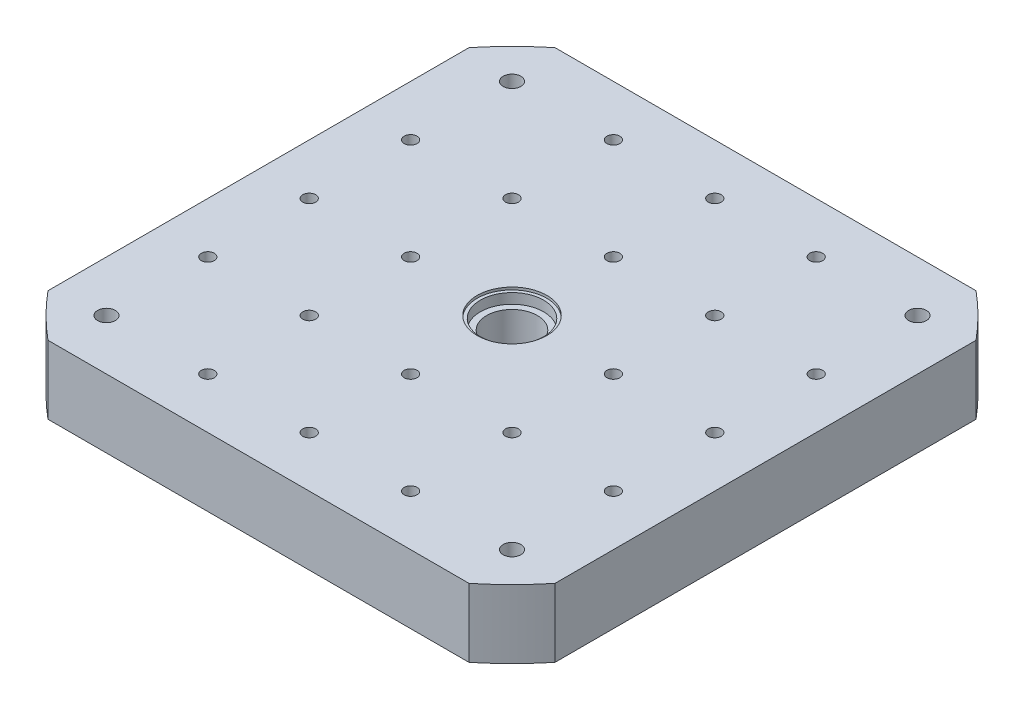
ISO-10303-21;
HEADER;
FILE_DESCRIPTION(('STEP AP214'),'2;1');
FILE_NAME('part.step','',(''),(''),'','','');
FILE_SCHEMA(('AUTOMOTIVE_DESIGN { 1 0 10303 214 1 1 1 1 }'));
ENDSEC;
DATA;
#1=APPLICATION_CONTEXT('core data for automotive mechanical design processes');
#2=APPLICATION_PROTOCOL_DEFINITION('international standard','automotive_design',2000,#1);
#3=PRODUCT_CONTEXT('',#1,'mechanical');
#4=PRODUCT('Part','Part','',(#3));
#5=PRODUCT_RELATED_PRODUCT_CATEGORY('part','',(#4));
#6=PRODUCT_DEFINITION_FORMATION('','',#4);
#7=PRODUCT_DEFINITION_CONTEXT('part definition',#1,'design');
#8=PRODUCT_DEFINITION('design','',#6,#7);
#9=PRODUCT_DEFINITION_SHAPE('','',#8);
#10=(LENGTH_UNIT() NAMED_UNIT(*) SI_UNIT(.MILLI.,.METRE.));
#11=(NAMED_UNIT(*) PLANE_ANGLE_UNIT() SI_UNIT($,.RADIAN.));
#12=(NAMED_UNIT(*) SI_UNIT($,.STERADIAN.) SOLID_ANGLE_UNIT());
#13=UNCERTAINTY_MEASURE_WITH_UNIT(LENGTH_MEASURE(1.E-05),#10,'distance_accuracy_value','');
#14=(GEOMETRIC_REPRESENTATION_CONTEXT(3) GLOBAL_UNCERTAINTY_ASSIGNED_CONTEXT((#13)) GLOBAL_UNIT_ASSIGNED_CONTEXT((#10,
#11,#12)) REPRESENTATION_CONTEXT('',''));
#15=CARTESIAN_POINT('',(0.,0.,0.));
#16=DIRECTION('',(0.,0.,1.));
#17=DIRECTION('',(1.,0.,0.));
#18=AXIS2_PLACEMENT_3D('',#15,#16,#17);
#19=CARTESIAN_POINT('',(0.,-54.,0.));
#20=DIRECTION('',(0.,1.,0.));
#21=DIRECTION('',(0.,0.,1.));
#22=AXIS2_PLACEMENT_3D('',#19,#20,#21);
#23=CYLINDRICAL_SURFACE('',#22,260.);
#24=CARTESIAN_POINT('',(0.,0.,0.));
#25=DIRECTION('',(0.,1.,0.));
#26=DIRECTION('',(0.,0.,1.));
#27=AXIS2_PLACEMENT_3D('',#24,#25,#26);
#28=CIRCLE('',#27,260.);
#29=CARTESIAN_POINT('',(166.132477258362,0.,200.));
#30=VERTEX_POINT('',#29);
#31=CARTESIAN_POINT('',(200.,0.,166.132477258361));
#32=VERTEX_POINT('',#31);
#33=EDGE_CURVE('E136',#30,#32,#28,.T.);
#34=ORIENTED_EDGE('',*,*,#33,.F.);
#35=DIRECTION('',(0.,1.,0.));
#36=VECTOR('',#35,1.);
#37=CARTESIAN_POINT('',(166.132477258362,-54.,200.));
#38=LINE('',#37,#36);
#39=CARTESIAN_POINT('',(166.132477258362,-54.,200.));
#40=VERTEX_POINT('',#39);
#41=EDGE_CURVE('E11',#40,#30,#38,.T.);
#42=ORIENTED_EDGE('',*,*,#41,.F.);
#43=CARTESIAN_POINT('',(0.,-54.,0.));
#44=DIRECTION('',(0.,1.,0.));
#45=DIRECTION('',(0.,0.,1.));
#46=AXIS2_PLACEMENT_3D('',#43,#44,#45);
#47=CIRCLE('',#46,260.);
#48=CARTESIAN_POINT('',(200.,-54.,166.132477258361));
#49=VERTEX_POINT('',#48);
#50=EDGE_CURVE('E157',#40,#49,#47,.T.);
#51=ORIENTED_EDGE('',*,*,#50,.T.);
#52=DIRECTION('',(0.,1.,0.));
#53=VECTOR('',#52,1.);
#54=CARTESIAN_POINT('',(200.,-54.,166.132477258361));
#55=LINE('',#54,#53);
#56=EDGE_CURVE('E92',#49,#32,#55,.T.);
#57=ORIENTED_EDGE('',*,*,#56,.T.);
#58=EDGE_LOOP('',(#34,#42,#51,#57));
#59=FACE_BOUND('',#58,.T.);
#60=ADVANCED_FACE('F35',(#59),#23,.T.);
#61=CARTESIAN_POINT('',(-166.132477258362,-54.,200.));
#62=DIRECTION('',(0.,0.,1.));
#63=DIRECTION('',(1.,0.,0.));
#64=AXIS2_PLACEMENT_3D('',#61,#62,#63);
#65=PLANE('',#64);
#66=DIRECTION('',(1.,0.,0.));
#67=VECTOR('',#66,1.);
#68=CARTESIAN_POINT('',(-166.132477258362,0.,200.));
#69=LINE('',#68,#67);
#70=CARTESIAN_POINT('',(-166.132477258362,0.,200.));
#71=VERTEX_POINT('',#70);
#72=EDGE_CURVE('E155',#71,#30,#69,.T.);
#73=ORIENTED_EDGE('',*,*,#72,.F.);
#74=DIRECTION('',(0.,1.,0.));
#75=VECTOR('',#74,1.);
#76=CARTESIAN_POINT('',(-166.132477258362,-54.,200.));
#77=LINE('',#76,#75);
#78=CARTESIAN_POINT('',(-166.132477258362,-54.,200.));
#79=VERTEX_POINT('',#78);
#80=EDGE_CURVE('E44',#79,#71,#77,.T.);
#81=ORIENTED_EDGE('',*,*,#80,.F.);
#82=DIRECTION('',(1.,0.,0.));
#83=VECTOR('',#82,1.);
#84=CARTESIAN_POINT('',(-166.132477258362,-54.,200.));
#85=LINE('',#84,#83);
#86=EDGE_CURVE('E126',#79,#40,#85,.T.);
#87=ORIENTED_EDGE('',*,*,#86,.T.);
#88=ORIENTED_EDGE('',*,*,#41,.T.);
#89=EDGE_LOOP('',(#73,#81,#87,#88));
#90=FACE_BOUND('',#89,.T.);
#91=ADVANCED_FACE('F170',(#90),#65,.T.);
#92=CARTESIAN_POINT('',(0.,-54.,0.));
#93=DIRECTION('',(0.,1.,0.));
#94=DIRECTION('',(0.,0.,1.));
#95=AXIS2_PLACEMENT_3D('',#92,#93,#94);
#96=CYLINDRICAL_SURFACE('',#95,260.);
#97=CARTESIAN_POINT('',(0.,0.,0.));
#98=DIRECTION('',(0.,1.,0.));
#99=DIRECTION('',(0.,0.,1.));
#100=AXIS2_PLACEMENT_3D('',#97,#98,#99);
#101=CIRCLE('',#100,260.);
#102=CARTESIAN_POINT('',(-200.,0.,166.132477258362));
#103=VERTEX_POINT('',#102);
#104=EDGE_CURVE('E113',#103,#71,#101,.T.);
#105=ORIENTED_EDGE('',*,*,#104,.F.);
#106=DIRECTION('',(0.,1.,0.));
#107=VECTOR('',#106,1.);
#108=CARTESIAN_POINT('',(-200.,-54.,166.132477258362));
#109=LINE('',#108,#107);
#110=CARTESIAN_POINT('',(-200.,-54.,166.132477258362));
#111=VERTEX_POINT('',#110);
#112=EDGE_CURVE('E108',#111,#103,#109,.T.);
#113=ORIENTED_EDGE('',*,*,#112,.F.);
#114=CARTESIAN_POINT('',(0.,-54.,0.));
#115=DIRECTION('',(0.,1.,0.));
#116=DIRECTION('',(0.,0.,1.));
#117=AXIS2_PLACEMENT_3D('',#114,#115,#116);
#118=CIRCLE('',#117,260.);
#119=EDGE_CURVE('E111',#111,#79,#118,.T.);
#120=ORIENTED_EDGE('',*,*,#119,.T.);
#121=ORIENTED_EDGE('',*,*,#80,.T.);
#122=EDGE_LOOP('',(#105,#113,#120,#121));
#123=FACE_BOUND('',#122,.T.);
#124=ADVANCED_FACE('F110',(#123),#96,.T.);
#125=CARTESIAN_POINT('',(-200.,-54.,-166.132477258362));
#126=DIRECTION('',(-1.,0.,0.));
#127=DIRECTION('',(0.,0.,1.));
#128=AXIS2_PLACEMENT_3D('',#125,#126,#127);
#129=PLANE('',#128);
#130=DIRECTION('',(0.,0.,1.));
#131=VECTOR('',#130,1.);
#132=CARTESIAN_POINT('',(-200.,0.,-166.132477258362));
#133=LINE('',#132,#131);
#134=CARTESIAN_POINT('',(-200.,0.,-166.132477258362));
#135=VERTEX_POINT('',#134);
#136=EDGE_CURVE('E152',#135,#103,#133,.T.);
#137=ORIENTED_EDGE('',*,*,#136,.F.);
#138=DIRECTION('',(0.,1.,0.));
#139=VECTOR('',#138,1.);
#140=CARTESIAN_POINT('',(-200.,-54.,-166.132477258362));
#141=LINE('',#140,#139);
#142=CARTESIAN_POINT('',(-200.,-54.,-166.132477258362));
#143=VERTEX_POINT('',#142);
#144=EDGE_CURVE('E118',#143,#135,#141,.T.);
#145=ORIENTED_EDGE('',*,*,#144,.F.);
#146=DIRECTION('',(0.,0.,1.));
#147=VECTOR('',#146,1.);
#148=CARTESIAN_POINT('',(-200.,-54.,-166.132477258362));
#149=LINE('',#148,#147);
#150=EDGE_CURVE('E124',#143,#111,#149,.T.);
#151=ORIENTED_EDGE('',*,*,#150,.T.);
#152=ORIENTED_EDGE('',*,*,#112,.T.);
#153=EDGE_LOOP('',(#137,#145,#151,#152));
#154=FACE_BOUND('',#153,.T.);
#155=ADVANCED_FACE('F128',(#154),#129,.T.);
#156=CARTESIAN_POINT('',(0.,-54.,0.));
#157=DIRECTION('',(0.,1.,0.));
#158=DIRECTION('',(0.,0.,1.));
#159=AXIS2_PLACEMENT_3D('',#156,#157,#158);
#160=CYLINDRICAL_SURFACE('',#159,260.);
#161=CARTESIAN_POINT('',(0.,0.,0.));
#162=DIRECTION('',(0.,1.,0.));
#163=DIRECTION('',(0.,0.,1.));
#164=AXIS2_PLACEMENT_3D('',#161,#162,#163);
#165=CIRCLE('',#164,260.);
#166=CARTESIAN_POINT('',(-166.132477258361,0.,-200.));
#167=VERTEX_POINT('',#166);
#168=EDGE_CURVE('E149',#167,#135,#165,.T.);
#169=ORIENTED_EDGE('',*,*,#168,.F.);
#170=DIRECTION('',(0.,1.,0.));
#171=VECTOR('',#170,1.);
#172=CARTESIAN_POINT('',(-166.132477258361,-54.,-200.));
#173=LINE('',#172,#171);
#174=CARTESIAN_POINT('',(-166.132477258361,-54.,-200.));
#175=VERTEX_POINT('',#174);
#176=EDGE_CURVE('E161',#175,#167,#173,.T.);
#177=ORIENTED_EDGE('',*,*,#176,.F.);
#178=CARTESIAN_POINT('',(0.,-54.,0.));
#179=DIRECTION('',(0.,1.,0.));
#180=DIRECTION('',(0.,0.,1.));
#181=AXIS2_PLACEMENT_3D('',#178,#179,#180);
#182=CIRCLE('',#181,260.);
#183=EDGE_CURVE('E129',#175,#143,#182,.T.);
#184=ORIENTED_EDGE('',*,*,#183,.T.);
#185=ORIENTED_EDGE('',*,*,#144,.T.);
#186=EDGE_LOOP('',(#169,#177,#184,#185));
#187=FACE_BOUND('',#186,.T.);
#188=ADVANCED_FACE('F183',(#187),#160,.T.);
#189=CARTESIAN_POINT('',(-166.132477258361,-54.,-200.));
#190=DIRECTION('',(0.,0.,-1.));
#191=DIRECTION('',(-1.,0.,0.));
#192=AXIS2_PLACEMENT_3D('',#189,#190,#191);
#193=PLANE('',#192);
#194=DIRECTION('',(-1.,0.,0.));
#195=VECTOR('',#194,1.);
#196=CARTESIAN_POINT('',(-166.132477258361,0.,-200.));
#197=LINE('',#196,#195);
#198=CARTESIAN_POINT('',(166.132477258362,0.,-200.));
#199=VERTEX_POINT('',#198);
#200=EDGE_CURVE('E146',#199,#167,#197,.T.);
#201=ORIENTED_EDGE('',*,*,#200,.F.);
#202=DIRECTION('',(0.,1.,0.));
#203=VECTOR('',#202,1.);
#204=CARTESIAN_POINT('',(166.132477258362,-54.,-200.));
#205=LINE('',#204,#203);
#206=CARTESIAN_POINT('',(166.132477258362,-54.,-200.));
#207=VERTEX_POINT('',#206);
#208=EDGE_CURVE('E163',#207,#199,#205,.T.);
#209=ORIENTED_EDGE('',*,*,#208,.F.);
#210=DIRECTION('',(-1.,0.,0.));
#211=VECTOR('',#210,1.);
#212=CARTESIAN_POINT('',(-166.132477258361,-54.,-200.));
#213=LINE('',#212,#211);
#214=EDGE_CURVE('E131',#207,#175,#213,.T.);
#215=ORIENTED_EDGE('',*,*,#214,.T.);
#216=ORIENTED_EDGE('',*,*,#176,.T.);
#217=EDGE_LOOP('',(#201,#209,#215,#216));
#218=FACE_BOUND('',#217,.T.);
#219=ADVANCED_FACE('F186',(#218),#193,.T.);
#220=CARTESIAN_POINT('',(0.,-54.,0.));
#221=DIRECTION('',(0.,1.,0.));
#222=DIRECTION('',(0.,0.,1.));
#223=AXIS2_PLACEMENT_3D('',#220,#221,#222);
#224=CYLINDRICAL_SURFACE('',#223,260.);
#225=CARTESIAN_POINT('',(0.,0.,0.));
#226=DIRECTION('',(0.,1.,0.));
#227=DIRECTION('',(0.,0.,1.));
#228=AXIS2_PLACEMENT_3D('',#225,#226,#227);
#229=CIRCLE('',#228,260.);
#230=CARTESIAN_POINT('',(200.,0.,-166.132477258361));
#231=VERTEX_POINT('',#230);
#232=EDGE_CURVE('E143',#231,#199,#229,.T.);
#233=ORIENTED_EDGE('',*,*,#232,.F.);
#234=DIRECTION('',(0.,1.,0.));
#235=VECTOR('',#234,1.);
#236=CARTESIAN_POINT('',(200.,-54.,-166.132477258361));
#237=LINE('',#236,#235);
#238=CARTESIAN_POINT('',(200.,-54.,-166.132477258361));
#239=VERTEX_POINT('',#238);
#240=EDGE_CURVE('E165',#239,#231,#237,.T.);
#241=ORIENTED_EDGE('',*,*,#240,.F.);
#242=CARTESIAN_POINT('',(0.,-54.,0.));
#243=DIRECTION('',(0.,1.,0.));
#244=DIRECTION('',(0.,0.,1.));
#245=AXIS2_PLACEMENT_3D('',#242,#243,#244);
#246=CIRCLE('',#245,260.);
#247=EDGE_CURVE('E583',#239,#207,#246,.T.);
#248=ORIENTED_EDGE('',*,*,#247,.T.);
#249=ORIENTED_EDGE('',*,*,#208,.T.);
#250=EDGE_LOOP('',(#233,#241,#248,#249));
#251=FACE_BOUND('',#250,.T.);
#252=ADVANCED_FACE('F190',(#251),#224,.T.);
#253=CARTESIAN_POINT('',(200.,-54.,-166.132477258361));
#254=DIRECTION('',(1.,0.,0.));
#255=DIRECTION('',(0.,0.,-1.));
#256=AXIS2_PLACEMENT_3D('',#253,#254,#255);
#257=PLANE('',#256);
#258=DIRECTION('',(0.,0.,-1.));
#259=VECTOR('',#258,1.);
#260=CARTESIAN_POINT('',(200.,0.,-166.132477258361));
#261=LINE('',#260,#259);
#262=EDGE_CURVE('E139',#32,#231,#261,.T.);
#263=ORIENTED_EDGE('',*,*,#262,.F.);
#264=ORIENTED_EDGE('',*,*,#56,.F.);
#265=DIRECTION('',(0.,0.,-1.));
#266=VECTOR('',#265,1.);
#267=CARTESIAN_POINT('',(200.,-54.,-166.132477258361));
#268=LINE('',#267,#266);
#269=EDGE_CURVE('E581',#49,#239,#268,.T.);
#270=ORIENTED_EDGE('',*,*,#269,.T.);
#271=ORIENTED_EDGE('',*,*,#240,.T.);
#272=EDGE_LOOP('',(#263,#264,#270,#271));
#273=FACE_BOUND('',#272,.T.);
#274=ADVANCED_FACE('F166',(#273),#257,.T.);
#275=CARTESIAN_POINT('',(0.,-54.,0.));
#276=DIRECTION('',(0.,1.,0.));
#277=DIRECTION('',(0.,0.,1.));
#278=AXIS2_PLACEMENT_3D('',#275,#276,#277);
#279=PLANE('',#278);
#280=CARTESIAN_POINT('',(0.,-54.,0.));
#281=DIRECTION('',(0.,1.,0.));
#282=DIRECTION('',(0.,0.,1.));
#283=AXIS2_PLACEMENT_3D('',#280,#281,#282);
#284=CIRCLE('',#283,20.);
#285=CARTESIAN_POINT('',(0.,-54.,20.));
#286=VERTEX_POINT('',#285);
#287=EDGE_CURVE('E449',#286,#286,#284,.F.);
#288=ORIENTED_EDGE('',*,*,#287,.F.);
#289=EDGE_LOOP('',(#288));
#290=FACE_BOUND('',#289,.T.);
#291=ORIENTED_EDGE('',*,*,#50,.F.);
#292=ORIENTED_EDGE('',*,*,#86,.F.);
#293=ORIENTED_EDGE('',*,*,#119,.F.);
#294=ORIENTED_EDGE('',*,*,#150,.F.);
#295=ORIENTED_EDGE('',*,*,#183,.F.);
#296=ORIENTED_EDGE('',*,*,#214,.F.);
#297=ORIENTED_EDGE('',*,*,#247,.F.);
#298=ORIENTED_EDGE('',*,*,#269,.F.);
#299=EDGE_LOOP('',(#291,#292,#293,#294,#295,#296,#297,#298));
#300=FACE_BOUND('',#299,.T.);
#301=ADVANCED_FACE('F122',(#290,#300),#279,.F.);
#302=CARTESIAN_POINT('',(0.,0.,0.));
#303=DIRECTION('',(0.,1.,0.));
#304=DIRECTION('',(0.,0.,1.));
#305=AXIS2_PLACEMENT_3D('',#302,#303,#304);
#306=PLANE('',#305);
#307=CARTESIAN_POINT('',(160.,0.,160.));
#308=DIRECTION('',(0.,1.,0.));
#309=DIRECTION('',(0.,0.,1.));
#310=AXIS2_PLACEMENT_3D('',#307,#308,#309);
#311=CIRCLE('',#310,7.00000000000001);
#312=CARTESIAN_POINT('',(160.,0.,167.));
#313=VERTEX_POINT('',#312);
#314=EDGE_CURVE('E424',#313,#313,#311,.T.);
#315=ORIENTED_EDGE('',*,*,#314,.F.);
#316=EDGE_LOOP('',(#315));
#317=FACE_BOUND('',#316,.T.);
#318=CARTESIAN_POINT('',(160.,0.,-160.));
#319=DIRECTION('',(0.,1.,0.));
#320=DIRECTION('',(0.,0.,1.));
#321=AXIS2_PLACEMENT_3D('',#318,#319,#320);
#322=CIRCLE('',#321,7.00000000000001);
#323=CARTESIAN_POINT('',(160.,0.,-153.));
#324=VERTEX_POINT('',#323);
#325=EDGE_CURVE('E426',#324,#324,#322,.T.);
#326=ORIENTED_EDGE('',*,*,#325,.F.);
#327=EDGE_LOOP('',(#326));
#328=FACE_BOUND('',#327,.T.);
#329=CARTESIAN_POINT('',(-160.,0.,160.));
#330=DIRECTION('',(0.,1.,0.));
#331=DIRECTION('',(0.,0.,1.));
#332=AXIS2_PLACEMENT_3D('',#329,#330,#331);
#333=CIRCLE('',#332,7.00000000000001);
#334=CARTESIAN_POINT('',(-160.,0.,167.));
#335=VERTEX_POINT('',#334);
#336=EDGE_CURVE('E434',#335,#335,#333,.T.);
#337=ORIENTED_EDGE('',*,*,#336,.F.);
#338=EDGE_LOOP('',(#337));
#339=FACE_BOUND('',#338,.T.);
#340=CARTESIAN_POINT('',(-160.,0.,-160.));
#341=DIRECTION('',(0.,1.,0.));
#342=DIRECTION('',(0.,0.,1.));
#343=AXIS2_PLACEMENT_3D('',#340,#341,#342);
#344=CIRCLE('',#343,7.00000000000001);
#345=CARTESIAN_POINT('',(-160.,0.,-153.));
#346=VERTEX_POINT('',#345);
#347=EDGE_CURVE('E440',#346,#346,#344,.T.);
#348=ORIENTED_EDGE('',*,*,#347,.F.);
#349=EDGE_LOOP('',(#348));
#350=FACE_BOUND('',#349,.T.);
#351=CARTESIAN_POINT('',(-80.,0.,-160.));
#352=DIRECTION('',(0.,1.,0.));
#353=DIRECTION('',(0.,0.,1.));
#354=AXIS2_PLACEMENT_3D('',#351,#352,#353);
#355=CIRCLE('',#354,5.09999999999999);
#356=CARTESIAN_POINT('',(-80.,0.,-154.9));
#357=VERTEX_POINT('',#356);
#358=EDGE_CURVE('E455',#357,#357,#355,.T.);
#359=ORIENTED_EDGE('',*,*,#358,.F.);
#360=EDGE_LOOP('',(#359));
#361=FACE_BOUND('',#360,.T.);
#362=CARTESIAN_POINT('',(0.,0.,-160.));
#363=DIRECTION('',(0.,1.,0.));
#364=DIRECTION('',(0.,0.,1.));
#365=AXIS2_PLACEMENT_3D('',#362,#363,#364);
#366=CIRCLE('',#365,5.1);
#367=CARTESIAN_POINT('',(0.,0.,-154.9));
#368=VERTEX_POINT('',#367);
#369=EDGE_CURVE('E461',#368,#368,#366,.T.);
#370=ORIENTED_EDGE('',*,*,#369,.F.);
#371=EDGE_LOOP('',(#370));
#372=FACE_BOUND('',#371,.T.);
#373=CARTESIAN_POINT('',(80.,0.,-160.));
#374=DIRECTION('',(0.,1.,0.));
#375=DIRECTION('',(0.,0.,1.));
#376=AXIS2_PLACEMENT_3D('',#373,#374,#375);
#377=CIRCLE('',#376,5.09999999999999);
#378=CARTESIAN_POINT('',(80.,0.,-154.9));
#379=VERTEX_POINT('',#378);
#380=EDGE_CURVE('E467',#379,#379,#377,.T.);
#381=ORIENTED_EDGE('',*,*,#380,.F.);
#382=EDGE_LOOP('',(#381));
#383=FACE_BOUND('',#382,.T.);
#384=CARTESIAN_POINT('',(-160.,0.,-80.));
#385=DIRECTION('',(0.,1.,0.));
#386=DIRECTION('',(0.,0.,1.));
#387=AXIS2_PLACEMENT_3D('',#384,#385,#386);
#388=CIRCLE('',#387,5.09999999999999);
#389=CARTESIAN_POINT('',(-160.,0.,-74.9));
#390=VERTEX_POINT('',#389);
#391=EDGE_CURVE('E473',#390,#390,#388,.T.);
#392=ORIENTED_EDGE('',*,*,#391,.F.);
#393=EDGE_LOOP('',(#392));
#394=FACE_BOUND('',#393,.T.);
#395=CARTESIAN_POINT('',(-80.,0.,-80.));
#396=DIRECTION('',(0.,1.,0.));
#397=DIRECTION('',(0.,0.,1.));
#398=AXIS2_PLACEMENT_3D('',#395,#396,#397);
#399=CIRCLE('',#398,5.09999999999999);
#400=CARTESIAN_POINT('',(-80.,0.,-74.9));
#401=VERTEX_POINT('',#400);
#402=EDGE_CURVE('E479',#401,#401,#399,.T.);
#403=ORIENTED_EDGE('',*,*,#402,.F.);
#404=EDGE_LOOP('',(#403));
#405=FACE_BOUND('',#404,.T.);
#406=CARTESIAN_POINT('',(0.,0.,-80.));
#407=DIRECTION('',(0.,1.,0.));
#408=DIRECTION('',(0.,0.,1.));
#409=AXIS2_PLACEMENT_3D('',#406,#407,#408);
#410=CIRCLE('',#409,5.1);
#411=CARTESIAN_POINT('',(0.,0.,-74.9));
#412=VERTEX_POINT('',#411);
#413=EDGE_CURVE('E485',#412,#412,#410,.T.);
#414=ORIENTED_EDGE('',*,*,#413,.F.);
#415=EDGE_LOOP('',(#414));
#416=FACE_BOUND('',#415,.T.);
#417=CARTESIAN_POINT('',(80.,0.,-80.));
#418=DIRECTION('',(0.,1.,0.));
#419=DIRECTION('',(0.,0.,1.));
#420=AXIS2_PLACEMENT_3D('',#417,#418,#419);
#421=CIRCLE('',#420,5.09999999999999);
#422=CARTESIAN_POINT('',(80.,0.,-74.9));
#423=VERTEX_POINT('',#422);
#424=EDGE_CURVE('E491',#423,#423,#421,.T.);
#425=ORIENTED_EDGE('',*,*,#424,.F.);
#426=EDGE_LOOP('',(#425));
#427=FACE_BOUND('',#426,.T.);
#428=CARTESIAN_POINT('',(160.,0.,-80.));
#429=DIRECTION('',(0.,1.,0.));
#430=DIRECTION('',(0.,0.,1.));
#431=AXIS2_PLACEMENT_3D('',#428,#429,#430);
#432=CIRCLE('',#431,5.09999999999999);
#433=CARTESIAN_POINT('',(160.,0.,-74.9));
#434=VERTEX_POINT('',#433);
#435=EDGE_CURVE('E497',#434,#434,#432,.T.);
#436=ORIENTED_EDGE('',*,*,#435,.F.);
#437=EDGE_LOOP('',(#436));
#438=FACE_BOUND('',#437,.T.);
#439=CARTESIAN_POINT('',(-160.,0.,0.));
#440=DIRECTION('',(0.,1.,0.));
#441=DIRECTION('',(0.,0.,1.));
#442=AXIS2_PLACEMENT_3D('',#439,#440,#441);
#443=CIRCLE('',#442,5.09999999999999);
#444=CARTESIAN_POINT('',(-160.,0.,5.09999999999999));
#445=VERTEX_POINT('',#444);
#446=EDGE_CURVE('E503',#445,#445,#443,.T.);
#447=ORIENTED_EDGE('',*,*,#446,.F.);
#448=EDGE_LOOP('',(#447));
#449=FACE_BOUND('',#448,.T.);
#450=CARTESIAN_POINT('',(-80.,0.,0.));
#451=DIRECTION('',(0.,1.,0.));
#452=DIRECTION('',(0.,0.,1.));
#453=AXIS2_PLACEMENT_3D('',#450,#451,#452);
#454=CIRCLE('',#453,5.09999999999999);
#455=CARTESIAN_POINT('',(-80.,0.,5.09999999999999));
#456=VERTEX_POINT('',#455);
#457=EDGE_CURVE('E509',#456,#456,#454,.T.);
#458=ORIENTED_EDGE('',*,*,#457,.F.);
#459=EDGE_LOOP('',(#458));
#460=FACE_BOUND('',#459,.T.);
#461=CARTESIAN_POINT('',(80.,0.,0.));
#462=DIRECTION('',(0.,1.,0.));
#463=DIRECTION('',(0.,0.,1.));
#464=AXIS2_PLACEMENT_3D('',#461,#462,#463);
#465=CIRCLE('',#464,5.09999999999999);
#466=CARTESIAN_POINT('',(80.,0.,5.09999999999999));
#467=VERTEX_POINT('',#466);
#468=EDGE_CURVE('E515',#467,#467,#465,.T.);
#469=ORIENTED_EDGE('',*,*,#468,.F.);
#470=EDGE_LOOP('',(#469));
#471=FACE_BOUND('',#470,.T.);
#472=CARTESIAN_POINT('',(160.,0.,0.));
#473=DIRECTION('',(0.,1.,0.));
#474=DIRECTION('',(0.,0.,1.));
#475=AXIS2_PLACEMENT_3D('',#472,#473,#474);
#476=CIRCLE('',#475,5.09999999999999);
#477=CARTESIAN_POINT('',(160.,0.,5.09999999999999));
#478=VERTEX_POINT('',#477);
#479=EDGE_CURVE('E521',#478,#478,#476,.T.);
#480=ORIENTED_EDGE('',*,*,#479,.F.);
#481=EDGE_LOOP('',(#480));
#482=FACE_BOUND('',#481,.T.);
#483=CARTESIAN_POINT('',(-160.,0.,80.));
#484=DIRECTION('',(0.,1.,0.));
#485=DIRECTION('',(0.,0.,1.));
#486=AXIS2_PLACEMENT_3D('',#483,#484,#485);
#487=CIRCLE('',#486,5.09999999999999);
#488=CARTESIAN_POINT('',(-160.,0.,85.1));
#489=VERTEX_POINT('',#488);
#490=EDGE_CURVE('E527',#489,#489,#487,.T.);
#491=ORIENTED_EDGE('',*,*,#490,.F.);
#492=EDGE_LOOP('',(#491));
#493=FACE_BOUND('',#492,.T.);
#494=CARTESIAN_POINT('',(-79.9999999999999,0.,80.));
#495=DIRECTION('',(0.,1.,0.));
#496=DIRECTION('',(0.,0.,1.));
#497=AXIS2_PLACEMENT_3D('',#494,#495,#496);
#498=CIRCLE('',#497,5.09999999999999);
#499=CARTESIAN_POINT('',(-79.9999999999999,0.,85.1));
#500=VERTEX_POINT('',#499);
#501=EDGE_CURVE('E533',#500,#500,#498,.T.);
#502=ORIENTED_EDGE('',*,*,#501,.F.);
#503=EDGE_LOOP('',(#502));
#504=FACE_BOUND('',#503,.T.);
#505=CARTESIAN_POINT('',(0.,0.,80.));
#506=DIRECTION('',(0.,1.,0.));
#507=DIRECTION('',(0.,0.,1.));
#508=AXIS2_PLACEMENT_3D('',#505,#506,#507);
#509=CIRCLE('',#508,5.1);
#510=CARTESIAN_POINT('',(0.,0.,85.1));
#511=VERTEX_POINT('',#510);
#512=EDGE_CURVE('E539',#511,#511,#509,.T.);
#513=ORIENTED_EDGE('',*,*,#512,.F.);
#514=EDGE_LOOP('',(#513));
#515=FACE_BOUND('',#514,.T.);
#516=CARTESIAN_POINT('',(80.,0.,80.));
#517=DIRECTION('',(0.,1.,0.));
#518=DIRECTION('',(0.,0.,1.));
#519=AXIS2_PLACEMENT_3D('',#516,#517,#518);
#520=CIRCLE('',#519,5.09999999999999);
#521=CARTESIAN_POINT('',(80.,0.,85.1));
#522=VERTEX_POINT('',#521);
#523=EDGE_CURVE('E545',#522,#522,#520,.T.);
#524=ORIENTED_EDGE('',*,*,#523,.F.);
#525=EDGE_LOOP('',(#524));
#526=FACE_BOUND('',#525,.T.);
#527=CARTESIAN_POINT('',(160.,0.,80.));
#528=DIRECTION('',(0.,1.,0.));
#529=DIRECTION('',(0.,0.,1.));
#530=AXIS2_PLACEMENT_3D('',#527,#528,#529);
#531=CIRCLE('',#530,5.09999999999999);
#532=CARTESIAN_POINT('',(160.,0.,85.1));
#533=VERTEX_POINT('',#532);
#534=EDGE_CURVE('E551',#533,#533,#531,.T.);
#535=ORIENTED_EDGE('',*,*,#534,.F.);
#536=EDGE_LOOP('',(#535));
#537=FACE_BOUND('',#536,.T.);
#538=CARTESIAN_POINT('',(-79.9999999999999,0.,160.));
#539=DIRECTION('',(0.,1.,0.));
#540=DIRECTION('',(0.,0.,1.));
#541=AXIS2_PLACEMENT_3D('',#538,#539,#540);
#542=CIRCLE('',#541,5.09999999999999);
#543=CARTESIAN_POINT('',(-79.9999999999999,0.,165.1));
#544=VERTEX_POINT('',#543);
#545=EDGE_CURVE('E557',#544,#544,#542,.T.);
#546=ORIENTED_EDGE('',*,*,#545,.F.);
#547=EDGE_LOOP('',(#546));
#548=FACE_BOUND('',#547,.T.);
#549=CARTESIAN_POINT('',(0.,0.,160.));
#550=DIRECTION('',(0.,1.,0.));
#551=DIRECTION('',(0.,0.,1.));
#552=AXIS2_PLACEMENT_3D('',#549,#550,#551);
#553=CIRCLE('',#552,5.1);
#554=CARTESIAN_POINT('',(0.,0.,165.1));
#555=VERTEX_POINT('',#554);
#556=EDGE_CURVE('E563',#555,#555,#553,.T.);
#557=ORIENTED_EDGE('',*,*,#556,.F.);
#558=EDGE_LOOP('',(#557));
#559=FACE_BOUND('',#558,.T.);
#560=CARTESIAN_POINT('',(80.0000000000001,0.,160.));
#561=DIRECTION('',(0.,1.,0.));
#562=DIRECTION('',(0.,0.,1.));
#563=AXIS2_PLACEMENT_3D('',#560,#561,#562);
#564=CIRCLE('',#563,5.09999999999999);
#565=CARTESIAN_POINT('',(80.0000000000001,0.,165.1));
#566=VERTEX_POINT('',#565);
#567=EDGE_CURVE('E569',#566,#566,#564,.T.);
#568=ORIENTED_EDGE('',*,*,#567,.F.);
#569=EDGE_LOOP('',(#568));
#570=FACE_BOUND('',#569,.T.);
#571=CARTESIAN_POINT('',(0.,0.,0.));
#572=DIRECTION('',(0.,1.,0.));
#573=DIRECTION('',(0.,0.,1.));
#574=AXIS2_PLACEMENT_3D('',#571,#572,#573);
#575=CIRCLE('',#574,27.5);
#576=CARTESIAN_POINT('',(0.,0.,27.5));
#577=VERTEX_POINT('',#576);
#578=EDGE_CURVE('E572',#577,#577,#575,.T.);
#579=ORIENTED_EDGE('',*,*,#578,.F.);
#580=EDGE_LOOP('',(#579));
#581=FACE_BOUND('',#580,.T.);
#582=ORIENTED_EDGE('',*,*,#33,.T.);
#583=ORIENTED_EDGE('',*,*,#262,.T.);
#584=ORIENTED_EDGE('',*,*,#232,.T.);
#585=ORIENTED_EDGE('',*,*,#200,.T.);
#586=ORIENTED_EDGE('',*,*,#168,.T.);
#587=ORIENTED_EDGE('',*,*,#136,.T.);
#588=ORIENTED_EDGE('',*,*,#104,.T.);
#589=ORIENTED_EDGE('',*,*,#72,.T.);
#590=EDGE_LOOP('',(#582,#583,#584,#585,#586,#587,#588,#589));
#591=FACE_BOUND('',#590,.T.);
#592=ADVANCED_FACE('F169',(#317,#328,#339,#350,#361,#372,#383,#394,#405,#416,#427,#438,#449,
#460,#471,#482,#493,#504,#515,#526,#537,#548,#559,#570,#581,#591),#306,.T.);
#593=CARTESIAN_POINT('',(0.,-2.,0.));
#594=DIRECTION('',(0.,1.,0.));
#595=DIRECTION('',(0.,0.,1.));
#596=AXIS2_PLACEMENT_3D('',#593,#594,#595);
#597=PLANE('',#596);
#598=CARTESIAN_POINT('',(0.,-2.,0.));
#599=DIRECTION('',(0.,1.,0.));
#600=DIRECTION('',(0.,0.,1.));
#601=AXIS2_PLACEMENT_3D('',#598,#599,#600);
#602=CIRCLE('',#601,27.5);
#603=CARTESIAN_POINT('',(0.,-2.,27.5));
#604=VERTEX_POINT('',#603);
#605=EDGE_CURVE('E573',#604,#604,#602,.T.);
#606=ORIENTED_EDGE('',*,*,#605,.T.);
#607=EDGE_LOOP('',(#606));
#608=FACE_BOUND('',#607,.T.);
#609=CARTESIAN_POINT('',(0.,-2.,0.));
#610=DIRECTION('',(0.,1.,0.));
#611=DIRECTION('',(0.,0.,1.));
#612=AXIS2_PLACEMENT_3D('',#609,#610,#611);
#613=CIRCLE('',#612,25.);
#614=CARTESIAN_POINT('',(0.,-2.,25.));
#615=VERTEX_POINT('',#614);
#616=EDGE_CURVE('E38',#615,#615,#613,.F.);
#617=ORIENTED_EDGE('',*,*,#616,.T.);
#618=EDGE_LOOP('',(#617));
#619=FACE_BOUND('',#618,.T.);
#620=ADVANCED_FACE('F202',(#608,#619),#597,.T.);
#621=CARTESIAN_POINT('',(0.,-2.,0.));
#622=DIRECTION('',(0.,1.,0.));
#623=DIRECTION('',(0.,0.,1.));
#624=AXIS2_PLACEMENT_3D('',#621,#622,#623);
#625=CYLINDRICAL_SURFACE('',#624,27.5);
#626=ORIENTED_EDGE('',*,*,#605,.F.);
#627=EDGE_LOOP('',(#626));
#628=FACE_BOUND('',#627,.T.);
#629=ORIENTED_EDGE('',*,*,#578,.T.);
#630=EDGE_LOOP('',(#629));
#631=FACE_BOUND('',#630,.T.);
#632=ADVANCED_FACE('F214',(#628,#631),#625,.F.);
#633=CARTESIAN_POINT('',(0.,-10.,0.));
#634=DIRECTION('',(0.,1.,0.));
#635=DIRECTION('',(0.,0.,1.));
#636=AXIS2_PLACEMENT_3D('',#633,#634,#635);
#637=PLANE('',#636);
#638=CARTESIAN_POINT('',(0.,-10.,0.));
#639=DIRECTION('',(0.,1.,0.));
#640=DIRECTION('',(0.,0.,1.));
#641=AXIS2_PLACEMENT_3D('',#638,#639,#640);
#642=CIRCLE('',#641,20.);
#643=CARTESIAN_POINT('',(0.,-10.,20.));
#644=VERTEX_POINT('',#643);
#645=EDGE_CURVE('E446',#644,#644,#642,.T.);
#646=ORIENTED_EDGE('',*,*,#645,.F.);
#647=EDGE_LOOP('',(#646));
#648=FACE_BOUND('',#647,.T.);
#649=CARTESIAN_POINT('',(0.,-10.,0.));
#650=DIRECTION('',(0.,1.,0.));
#651=DIRECTION('',(0.,0.,1.));
#652=AXIS2_PLACEMENT_3D('',#649,#650,#651);
#653=CIRCLE('',#652,25.);
#654=CARTESIAN_POINT('',(0.,-10.,25.));
#655=VERTEX_POINT('',#654);
#656=EDGE_CURVE('E140',#655,#655,#653,.T.);
#657=ORIENTED_EDGE('',*,*,#656,.T.);
#658=EDGE_LOOP('',(#657));
#659=FACE_BOUND('',#658,.T.);
#660=ADVANCED_FACE('F210',(#648,#659),#637,.T.);
#661=CARTESIAN_POINT('',(0.,-10.,0.));
#662=DIRECTION('',(0.,1.,0.));
#663=DIRECTION('',(0.,0.,1.));
#664=AXIS2_PLACEMENT_3D('',#661,#662,#663);
#665=CYLINDRICAL_SURFACE('',#664,25.);
#666=ORIENTED_EDGE('',*,*,#656,.F.);
#667=EDGE_LOOP('',(#666));
#668=FACE_BOUND('',#667,.T.);
#669=ORIENTED_EDGE('',*,*,#616,.F.);
#670=EDGE_LOOP('',(#669));
#671=FACE_BOUND('',#670,.T.);
#672=ADVANCED_FACE('F206',(#668,#671),#665,.F.);
#673=CARTESIAN_POINT('',(80.0000000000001,0.,160.));
#674=DIRECTION('',(0.,1.,0.));
#675=DIRECTION('',(0.,0.,1.));
#676=AXIS2_PLACEMENT_3D('',#673,#674,#675);
#677=CYLINDRICAL_SURFACE('',#676,5.09999999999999);
#678=CARTESIAN_POINT('',(80.0000000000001,-29.25,160.));
#679=DIRECTION('',(0.,1.,0.));
#680=DIRECTION('',(0.,0.,1.));
#681=AXIS2_PLACEMENT_3D('',#678,#679,#680);
#682=CIRCLE('',#681,5.09999999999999);
#683=CARTESIAN_POINT('',(80.0000000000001,-29.25,165.1));
#684=VERTEX_POINT('',#683);
#685=EDGE_CURVE('E566',#684,#684,#682,.T.);
#686=ORIENTED_EDGE('',*,*,#685,.F.);
#687=EDGE_LOOP('',(#686));
#688=FACE_BOUND('',#687,.T.);
#689=ORIENTED_EDGE('',*,*,#567,.T.);
#690=EDGE_LOOP('',(#689));
#691=FACE_BOUND('',#690,.T.);
#692=ADVANCED_FACE('F209',(#688,#691),#677,.F.);
#693=CARTESIAN_POINT('',(80.0000000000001,-29.25,160.));
#694=DIRECTION('',(0.,1.,0.));
#695=DIRECTION('',(0.,0.,1.));
#696=AXIS2_PLACEMENT_3D('',#693,#694,#695);
#697=CONICAL_SURFACE('',#696,5.09999999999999,1.02974425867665);
#698=CARTESIAN_POINT('',(80.,-32.3143891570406,160.));
#699=VERTEX_POINT('',#698);
#700=VERTEX_LOOP('',#699);
#701=FACE_BOUND('',#700,.T.);
#702=ORIENTED_EDGE('',*,*,#685,.T.);
#703=EDGE_LOOP('',(#702));
#704=FACE_BOUND('',#703,.T.);
#705=ADVANCED_FACE('F224',(#701,#704),#697,.F.);
#706=CARTESIAN_POINT('',(0.,0.,160.));
#707=DIRECTION('',(0.,1.,0.));
#708=DIRECTION('',(0.,0.,1.));
#709=AXIS2_PLACEMENT_3D('',#706,#707,#708);
#710=CYLINDRICAL_SURFACE('',#709,5.1);
#711=CARTESIAN_POINT('',(0.,-29.25,160.));
#712=DIRECTION('',(0.,1.,0.));
#713=DIRECTION('',(0.,0.,1.));
#714=AXIS2_PLACEMENT_3D('',#711,#712,#713);
#715=CIRCLE('',#714,5.09999999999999);
#716=CARTESIAN_POINT('',(0.,-29.25,165.1));
#717=VERTEX_POINT('',#716);
#718=EDGE_CURVE('E560',#717,#717,#715,.T.);
#719=ORIENTED_EDGE('',*,*,#718,.F.);
#720=EDGE_LOOP('',(#719));
#721=FACE_BOUND('',#720,.T.);
#722=ORIENTED_EDGE('',*,*,#556,.T.);
#723=EDGE_LOOP('',(#722));
#724=FACE_BOUND('',#723,.T.);
#725=ADVANCED_FACE('F228',(#721,#724),#710,.F.);
#726=CARTESIAN_POINT('',(0.,-29.25,160.));
#727=DIRECTION('',(0.,1.,0.));
#728=DIRECTION('',(0.,0.,1.));
#729=AXIS2_PLACEMENT_3D('',#726,#727,#728);
#730=CONICAL_SURFACE('',#729,5.09999999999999,1.02974425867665);
#731=CARTESIAN_POINT('',(0.,-32.3143891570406,160.));
#732=VERTEX_POINT('',#731);
#733=VERTEX_LOOP('',#732);
#734=FACE_BOUND('',#733,.T.);
#735=ORIENTED_EDGE('',*,*,#718,.T.);
#736=EDGE_LOOP('',(#735));
#737=FACE_BOUND('',#736,.T.);
#738=ADVANCED_FACE('F232',(#734,#737),#730,.F.);
#739=CARTESIAN_POINT('',(-79.9999999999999,0.,160.));
#740=DIRECTION('',(0.,1.,0.));
#741=DIRECTION('',(0.,0.,1.));
#742=AXIS2_PLACEMENT_3D('',#739,#740,#741);
#743=CYLINDRICAL_SURFACE('',#742,5.09999999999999);
#744=CARTESIAN_POINT('',(-79.9999999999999,-29.25,160.));
#745=DIRECTION('',(0.,1.,0.));
#746=DIRECTION('',(0.,0.,1.));
#747=AXIS2_PLACEMENT_3D('',#744,#745,#746);
#748=CIRCLE('',#747,5.09999999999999);
#749=CARTESIAN_POINT('',(-79.9999999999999,-29.25,165.1));
#750=VERTEX_POINT('',#749);
#751=EDGE_CURVE('E554',#750,#750,#748,.T.);
#752=ORIENTED_EDGE('',*,*,#751,.F.);
#753=EDGE_LOOP('',(#752));
#754=FACE_BOUND('',#753,.T.);
#755=ORIENTED_EDGE('',*,*,#545,.T.);
#756=EDGE_LOOP('',(#755));
#757=FACE_BOUND('',#756,.T.);
#758=ADVANCED_FACE('F236',(#754,#757),#743,.F.);
#759=CARTESIAN_POINT('',(-79.9999999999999,-29.25,160.));
#760=DIRECTION('',(0.,1.,0.));
#761=DIRECTION('',(0.,0.,1.));
#762=AXIS2_PLACEMENT_3D('',#759,#760,#761);
#763=CONICAL_SURFACE('',#762,5.09999999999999,1.02974425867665);
#764=CARTESIAN_POINT('',(-79.9999999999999,-32.3143891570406,160.));
#765=VERTEX_POINT('',#764);
#766=VERTEX_LOOP('',#765);
#767=FACE_BOUND('',#766,.T.);
#768=ORIENTED_EDGE('',*,*,#751,.T.);
#769=EDGE_LOOP('',(#768));
#770=FACE_BOUND('',#769,.T.);
#771=ADVANCED_FACE('F240',(#767,#770),#763,.F.);
#772=CARTESIAN_POINT('',(160.,0.,80.));
#773=DIRECTION('',(0.,1.,0.));
#774=DIRECTION('',(0.,0.,1.));
#775=AXIS2_PLACEMENT_3D('',#772,#773,#774);
#776=CYLINDRICAL_SURFACE('',#775,5.09999999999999);
#777=CARTESIAN_POINT('',(160.,-29.25,80.));
#778=DIRECTION('',(0.,1.,0.));
#779=DIRECTION('',(0.,0.,1.));
#780=AXIS2_PLACEMENT_3D('',#777,#778,#779);
#781=CIRCLE('',#780,5.09999999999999);
#782=CARTESIAN_POINT('',(160.,-29.25,85.1));
#783=VERTEX_POINT('',#782);
#784=EDGE_CURVE('E548',#783,#783,#781,.T.);
#785=ORIENTED_EDGE('',*,*,#784,.F.);
#786=EDGE_LOOP('',(#785));
#787=FACE_BOUND('',#786,.T.);
#788=ORIENTED_EDGE('',*,*,#534,.T.);
#789=EDGE_LOOP('',(#788));
#790=FACE_BOUND('',#789,.T.);
#791=ADVANCED_FACE('F244',(#787,#790),#776,.F.);
#792=CARTESIAN_POINT('',(160.,-29.25,80.));
#793=DIRECTION('',(0.,1.,0.));
#794=DIRECTION('',(0.,0.,1.));
#795=AXIS2_PLACEMENT_3D('',#792,#793,#794);
#796=CONICAL_SURFACE('',#795,5.09999999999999,1.02974425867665);
#797=CARTESIAN_POINT('',(160.,-32.3143891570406,80.));
#798=VERTEX_POINT('',#797);
#799=VERTEX_LOOP('',#798);
#800=FACE_BOUND('',#799,.T.);
#801=ORIENTED_EDGE('',*,*,#784,.T.);
#802=EDGE_LOOP('',(#801));
#803=FACE_BOUND('',#802,.T.);
#804=ADVANCED_FACE('F248',(#800,#803),#796,.F.);
#805=CARTESIAN_POINT('',(80.,0.,80.));
#806=DIRECTION('',(0.,1.,0.));
#807=DIRECTION('',(0.,0.,1.));
#808=AXIS2_PLACEMENT_3D('',#805,#806,#807);
#809=CYLINDRICAL_SURFACE('',#808,5.09999999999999);
#810=CARTESIAN_POINT('',(80.,-29.25,80.));
#811=DIRECTION('',(0.,1.,0.));
#812=DIRECTION('',(0.,0.,1.));
#813=AXIS2_PLACEMENT_3D('',#810,#811,#812);
#814=CIRCLE('',#813,5.09999999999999);
#815=CARTESIAN_POINT('',(80.,-29.25,85.1));
#816=VERTEX_POINT('',#815);
#817=EDGE_CURVE('E542',#816,#816,#814,.T.);
#818=ORIENTED_EDGE('',*,*,#817,.F.);
#819=EDGE_LOOP('',(#818));
#820=FACE_BOUND('',#819,.T.);
#821=ORIENTED_EDGE('',*,*,#523,.T.);
#822=EDGE_LOOP('',(#821));
#823=FACE_BOUND('',#822,.T.);
#824=ADVANCED_FACE('F252',(#820,#823),#809,.F.);
#825=CARTESIAN_POINT('',(80.,-29.25,80.));
#826=DIRECTION('',(0.,1.,0.));
#827=DIRECTION('',(0.,0.,1.));
#828=AXIS2_PLACEMENT_3D('',#825,#826,#827);
#829=CONICAL_SURFACE('',#828,5.09999999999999,1.02974425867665);
#830=CARTESIAN_POINT('',(80.,-32.3143891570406,80.));
#831=VERTEX_POINT('',#830);
#832=VERTEX_LOOP('',#831);
#833=FACE_BOUND('',#832,.T.);
#834=ORIENTED_EDGE('',*,*,#817,.T.);
#835=EDGE_LOOP('',(#834));
#836=FACE_BOUND('',#835,.T.);
#837=ADVANCED_FACE('F256',(#833,#836),#829,.F.);
#838=CARTESIAN_POINT('',(0.,0.,80.));
#839=DIRECTION('',(0.,1.,0.));
#840=DIRECTION('',(0.,0.,1.));
#841=AXIS2_PLACEMENT_3D('',#838,#839,#840);
#842=CYLINDRICAL_SURFACE('',#841,5.1);
#843=CARTESIAN_POINT('',(0.,-29.25,80.));
#844=DIRECTION('',(0.,1.,0.));
#845=DIRECTION('',(0.,0.,1.));
#846=AXIS2_PLACEMENT_3D('',#843,#844,#845);
#847=CIRCLE('',#846,5.09999999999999);
#848=CARTESIAN_POINT('',(0.,-29.25,85.1));
#849=VERTEX_POINT('',#848);
#850=EDGE_CURVE('E536',#849,#849,#847,.T.);
#851=ORIENTED_EDGE('',*,*,#850,.F.);
#852=EDGE_LOOP('',(#851));
#853=FACE_BOUND('',#852,.T.);
#854=ORIENTED_EDGE('',*,*,#512,.T.);
#855=EDGE_LOOP('',(#854));
#856=FACE_BOUND('',#855,.T.);
#857=ADVANCED_FACE('F260',(#853,#856),#842,.F.);
#858=CARTESIAN_POINT('',(0.,-29.25,80.));
#859=DIRECTION('',(0.,1.,0.));
#860=DIRECTION('',(0.,0.,1.));
#861=AXIS2_PLACEMENT_3D('',#858,#859,#860);
#862=CONICAL_SURFACE('',#861,5.09999999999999,1.02974425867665);
#863=CARTESIAN_POINT('',(0.,-32.3143891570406,80.));
#864=VERTEX_POINT('',#863);
#865=VERTEX_LOOP('',#864);
#866=FACE_BOUND('',#865,.T.);
#867=ORIENTED_EDGE('',*,*,#850,.T.);
#868=EDGE_LOOP('',(#867));
#869=FACE_BOUND('',#868,.T.);
#870=ADVANCED_FACE('F264',(#866,#869),#862,.F.);
#871=CARTESIAN_POINT('',(-79.9999999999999,0.,80.));
#872=DIRECTION('',(0.,1.,0.));
#873=DIRECTION('',(0.,0.,1.));
#874=AXIS2_PLACEMENT_3D('',#871,#872,#873);
#875=CYLINDRICAL_SURFACE('',#874,5.09999999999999);
#876=CARTESIAN_POINT('',(-79.9999999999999,-29.25,80.));
#877=DIRECTION('',(0.,1.,0.));
#878=DIRECTION('',(0.,0.,1.));
#879=AXIS2_PLACEMENT_3D('',#876,#877,#878);
#880=CIRCLE('',#879,5.09999999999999);
#881=CARTESIAN_POINT('',(-79.9999999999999,-29.25,85.1));
#882=VERTEX_POINT('',#881);
#883=EDGE_CURVE('E530',#882,#882,#880,.T.);
#884=ORIENTED_EDGE('',*,*,#883,.F.);
#885=EDGE_LOOP('',(#884));
#886=FACE_BOUND('',#885,.T.);
#887=ORIENTED_EDGE('',*,*,#501,.T.);
#888=EDGE_LOOP('',(#887));
#889=FACE_BOUND('',#888,.T.);
#890=ADVANCED_FACE('F268',(#886,#889),#875,.F.);
#891=CARTESIAN_POINT('',(-79.9999999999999,-29.25,80.));
#892=DIRECTION('',(0.,1.,0.));
#893=DIRECTION('',(0.,0.,1.));
#894=AXIS2_PLACEMENT_3D('',#891,#892,#893);
#895=CONICAL_SURFACE('',#894,5.09999999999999,1.02974425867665);
#896=CARTESIAN_POINT('',(-79.9999999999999,-32.3143891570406,80.));
#897=VERTEX_POINT('',#896);
#898=VERTEX_LOOP('',#897);
#899=FACE_BOUND('',#898,.T.);
#900=ORIENTED_EDGE('',*,*,#883,.T.);
#901=EDGE_LOOP('',(#900));
#902=FACE_BOUND('',#901,.T.);
#903=ADVANCED_FACE('F272',(#899,#902),#895,.F.);
#904=CARTESIAN_POINT('',(-160.,0.,80.));
#905=DIRECTION('',(0.,1.,0.));
#906=DIRECTION('',(0.,0.,1.));
#907=AXIS2_PLACEMENT_3D('',#904,#905,#906);
#908=CYLINDRICAL_SURFACE('',#907,5.09999999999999);
#909=CARTESIAN_POINT('',(-160.,-29.25,80.));
#910=DIRECTION('',(0.,1.,0.));
#911=DIRECTION('',(0.,0.,1.));
#912=AXIS2_PLACEMENT_3D('',#909,#910,#911);
#913=CIRCLE('',#912,5.09999999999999);
#914=CARTESIAN_POINT('',(-160.,-29.25,85.1));
#915=VERTEX_POINT('',#914);
#916=EDGE_CURVE('E524',#915,#915,#913,.T.);
#917=ORIENTED_EDGE('',*,*,#916,.F.);
#918=EDGE_LOOP('',(#917));
#919=FACE_BOUND('',#918,.T.);
#920=ORIENTED_EDGE('',*,*,#490,.T.);
#921=EDGE_LOOP('',(#920));
#922=FACE_BOUND('',#921,.T.);
#923=ADVANCED_FACE('F276',(#919,#922),#908,.F.);
#924=CARTESIAN_POINT('',(-160.,-29.25,80.));
#925=DIRECTION('',(0.,1.,0.));
#926=DIRECTION('',(0.,0.,1.));
#927=AXIS2_PLACEMENT_3D('',#924,#925,#926);
#928=CONICAL_SURFACE('',#927,5.09999999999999,1.02974425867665);
#929=CARTESIAN_POINT('',(-160.,-32.3143891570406,80.));
#930=VERTEX_POINT('',#929);
#931=VERTEX_LOOP('',#930);
#932=FACE_BOUND('',#931,.T.);
#933=ORIENTED_EDGE('',*,*,#916,.T.);
#934=EDGE_LOOP('',(#933));
#935=FACE_BOUND('',#934,.T.);
#936=ADVANCED_FACE('F280',(#932,#935),#928,.F.);
#937=CARTESIAN_POINT('',(160.,0.,0.));
#938=DIRECTION('',(0.,1.,0.));
#939=DIRECTION('',(0.,0.,1.));
#940=AXIS2_PLACEMENT_3D('',#937,#938,#939);
#941=CYLINDRICAL_SURFACE('',#940,5.09999999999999);
#942=CARTESIAN_POINT('',(160.,-29.25,0.));
#943=DIRECTION('',(0.,1.,0.));
#944=DIRECTION('',(0.,0.,1.));
#945=AXIS2_PLACEMENT_3D('',#942,#943,#944);
#946=CIRCLE('',#945,5.09999999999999);
#947=CARTESIAN_POINT('',(160.,-29.25,5.09999999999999));
#948=VERTEX_POINT('',#947);
#949=EDGE_CURVE('E518',#948,#948,#946,.T.);
#950=ORIENTED_EDGE('',*,*,#949,.F.);
#951=EDGE_LOOP('',(#950));
#952=FACE_BOUND('',#951,.T.);
#953=ORIENTED_EDGE('',*,*,#479,.T.);
#954=EDGE_LOOP('',(#953));
#955=FACE_BOUND('',#954,.T.);
#956=ADVANCED_FACE('F284',(#952,#955),#941,.F.);
#957=CARTESIAN_POINT('',(160.,-29.25,0.));
#958=DIRECTION('',(0.,1.,0.));
#959=DIRECTION('',(0.,0.,1.));
#960=AXIS2_PLACEMENT_3D('',#957,#958,#959);
#961=CONICAL_SURFACE('',#960,5.09999999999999,1.02974425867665);
#962=CARTESIAN_POINT('',(160.,-32.3143891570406,0.));
#963=VERTEX_POINT('',#962);
#964=VERTEX_LOOP('',#963);
#965=FACE_BOUND('',#964,.T.);
#966=ORIENTED_EDGE('',*,*,#949,.T.);
#967=EDGE_LOOP('',(#966));
#968=FACE_BOUND('',#967,.T.);
#969=ADVANCED_FACE('F288',(#965,#968),#961,.F.);
#970=CARTESIAN_POINT('',(80.,0.,0.));
#971=DIRECTION('',(0.,1.,0.));
#972=DIRECTION('',(0.,0.,1.));
#973=AXIS2_PLACEMENT_3D('',#970,#971,#972);
#974=CYLINDRICAL_SURFACE('',#973,5.09999999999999);
#975=CARTESIAN_POINT('',(80.,-29.25,0.));
#976=DIRECTION('',(0.,1.,0.));
#977=DIRECTION('',(0.,0.,1.));
#978=AXIS2_PLACEMENT_3D('',#975,#976,#977);
#979=CIRCLE('',#978,5.09999999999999);
#980=CARTESIAN_POINT('',(80.,-29.25,5.09999999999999));
#981=VERTEX_POINT('',#980);
#982=EDGE_CURVE('E512',#981,#981,#979,.T.);
#983=ORIENTED_EDGE('',*,*,#982,.F.);
#984=EDGE_LOOP('',(#983));
#985=FACE_BOUND('',#984,.T.);
#986=ORIENTED_EDGE('',*,*,#468,.T.);
#987=EDGE_LOOP('',(#986));
#988=FACE_BOUND('',#987,.T.);
#989=ADVANCED_FACE('F292',(#985,#988),#974,.F.);
#990=CARTESIAN_POINT('',(80.,-29.25,0.));
#991=DIRECTION('',(0.,1.,0.));
#992=DIRECTION('',(0.,0.,1.));
#993=AXIS2_PLACEMENT_3D('',#990,#991,#992);
#994=CONICAL_SURFACE('',#993,5.09999999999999,1.02974425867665);
#995=CARTESIAN_POINT('',(80.,-32.3143891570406,0.));
#996=VERTEX_POINT('',#995);
#997=VERTEX_LOOP('',#996);
#998=FACE_BOUND('',#997,.T.);
#999=ORIENTED_EDGE('',*,*,#982,.T.);
#1000=EDGE_LOOP('',(#999));
#1001=FACE_BOUND('',#1000,.T.);
#1002=ADVANCED_FACE('F296',(#998,#1001),#994,.F.);
#1003=CARTESIAN_POINT('',(-80.,0.,0.));
#1004=DIRECTION('',(0.,1.,0.));
#1005=DIRECTION('',(0.,0.,1.));
#1006=AXIS2_PLACEMENT_3D('',#1003,#1004,#1005);
#1007=CYLINDRICAL_SURFACE('',#1006,5.09999999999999);
#1008=CARTESIAN_POINT('',(-80.,-29.25,0.));
#1009=DIRECTION('',(0.,1.,0.));
#1010=DIRECTION('',(0.,0.,1.));
#1011=AXIS2_PLACEMENT_3D('',#1008,#1009,#1010);
#1012=CIRCLE('',#1011,5.09999999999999);
#1013=CARTESIAN_POINT('',(-80.,-29.25,5.09999999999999));
#1014=VERTEX_POINT('',#1013);
#1015=EDGE_CURVE('E506',#1014,#1014,#1012,.T.);
#1016=ORIENTED_EDGE('',*,*,#1015,.F.);
#1017=EDGE_LOOP('',(#1016));
#1018=FACE_BOUND('',#1017,.T.);
#1019=ORIENTED_EDGE('',*,*,#457,.T.);
#1020=EDGE_LOOP('',(#1019));
#1021=FACE_BOUND('',#1020,.T.);
#1022=ADVANCED_FACE('F300',(#1018,#1021),#1007,.F.);
#1023=CARTESIAN_POINT('',(-80.,-29.25,0.));
#1024=DIRECTION('',(0.,1.,0.));
#1025=DIRECTION('',(0.,0.,1.));
#1026=AXIS2_PLACEMENT_3D('',#1023,#1024,#1025);
#1027=CONICAL_SURFACE('',#1026,5.09999999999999,1.02974425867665);
#1028=CARTESIAN_POINT('',(-80.,-32.3143891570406,0.));
#1029=VERTEX_POINT('',#1028);
#1030=VERTEX_LOOP('',#1029);
#1031=FACE_BOUND('',#1030,.T.);
#1032=ORIENTED_EDGE('',*,*,#1015,.T.);
#1033=EDGE_LOOP('',(#1032));
#1034=FACE_BOUND('',#1033,.T.);
#1035=ADVANCED_FACE('F304',(#1031,#1034),#1027,.F.);
#1036=CARTESIAN_POINT('',(-160.,0.,0.));
#1037=DIRECTION('',(0.,1.,0.));
#1038=DIRECTION('',(0.,0.,1.));
#1039=AXIS2_PLACEMENT_3D('',#1036,#1037,#1038);
#1040=CYLINDRICAL_SURFACE('',#1039,5.09999999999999);
#1041=CARTESIAN_POINT('',(-160.,-29.25,0.));
#1042=DIRECTION('',(0.,1.,0.));
#1043=DIRECTION('',(0.,0.,1.));
#1044=AXIS2_PLACEMENT_3D('',#1041,#1042,#1043);
#1045=CIRCLE('',#1044,5.09999999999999);
#1046=CARTESIAN_POINT('',(-160.,-29.25,5.09999999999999));
#1047=VERTEX_POINT('',#1046);
#1048=EDGE_CURVE('E500',#1047,#1047,#1045,.T.);
#1049=ORIENTED_EDGE('',*,*,#1048,.F.);
#1050=EDGE_LOOP('',(#1049));
#1051=FACE_BOUND('',#1050,.T.);
#1052=ORIENTED_EDGE('',*,*,#446,.T.);
#1053=EDGE_LOOP('',(#1052));
#1054=FACE_BOUND('',#1053,.T.);
#1055=ADVANCED_FACE('F308',(#1051,#1054),#1040,.F.);
#1056=CARTESIAN_POINT('',(-160.,-29.25,0.));
#1057=DIRECTION('',(0.,1.,0.));
#1058=DIRECTION('',(0.,0.,1.));
#1059=AXIS2_PLACEMENT_3D('',#1056,#1057,#1058);
#1060=CONICAL_SURFACE('',#1059,5.09999999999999,1.02974425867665);
#1061=CARTESIAN_POINT('',(-160.,-32.3143891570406,0.));
#1062=VERTEX_POINT('',#1061);
#1063=VERTEX_LOOP('',#1062);
#1064=FACE_BOUND('',#1063,.T.);
#1065=ORIENTED_EDGE('',*,*,#1048,.T.);
#1066=EDGE_LOOP('',(#1065));
#1067=FACE_BOUND('',#1066,.T.);
#1068=ADVANCED_FACE('F312',(#1064,#1067),#1060,.F.);
#1069=CARTESIAN_POINT('',(160.,0.,-80.));
#1070=DIRECTION('',(0.,1.,0.));
#1071=DIRECTION('',(0.,0.,1.));
#1072=AXIS2_PLACEMENT_3D('',#1069,#1070,#1071);
#1073=CYLINDRICAL_SURFACE('',#1072,5.09999999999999);
#1074=CARTESIAN_POINT('',(160.,-29.25,-80.));
#1075=DIRECTION('',(0.,1.,0.));
#1076=DIRECTION('',(0.,0.,1.));
#1077=AXIS2_PLACEMENT_3D('',#1074,#1075,#1076);
#1078=CIRCLE('',#1077,5.09999999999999);
#1079=CARTESIAN_POINT('',(160.,-29.25,-74.9));
#1080=VERTEX_POINT('',#1079);
#1081=EDGE_CURVE('E494',#1080,#1080,#1078,.T.);
#1082=ORIENTED_EDGE('',*,*,#1081,.F.);
#1083=EDGE_LOOP('',(#1082));
#1084=FACE_BOUND('',#1083,.T.);
#1085=ORIENTED_EDGE('',*,*,#435,.T.);
#1086=EDGE_LOOP('',(#1085));
#1087=FACE_BOUND('',#1086,.T.);
#1088=ADVANCED_FACE('F316',(#1084,#1087),#1073,.F.);
#1089=CARTESIAN_POINT('',(160.,-29.25,-80.));
#1090=DIRECTION('',(0.,1.,0.));
#1091=DIRECTION('',(0.,0.,1.));
#1092=AXIS2_PLACEMENT_3D('',#1089,#1090,#1091);
#1093=CONICAL_SURFACE('',#1092,5.09999999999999,1.02974425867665);
#1094=CARTESIAN_POINT('',(160.,-32.3143891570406,-80.));
#1095=VERTEX_POINT('',#1094);
#1096=VERTEX_LOOP('',#1095);
#1097=FACE_BOUND('',#1096,.T.);
#1098=ORIENTED_EDGE('',*,*,#1081,.T.);
#1099=EDGE_LOOP('',(#1098));
#1100=FACE_BOUND('',#1099,.T.);
#1101=ADVANCED_FACE('F320',(#1097,#1100),#1093,.F.);
#1102=CARTESIAN_POINT('',(80.,0.,-80.));
#1103=DIRECTION('',(0.,1.,0.));
#1104=DIRECTION('',(0.,0.,1.));
#1105=AXIS2_PLACEMENT_3D('',#1102,#1103,#1104);
#1106=CYLINDRICAL_SURFACE('',#1105,5.09999999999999);
#1107=CARTESIAN_POINT('',(80.,-29.25,-80.));
#1108=DIRECTION('',(0.,1.,0.));
#1109=DIRECTION('',(0.,0.,1.));
#1110=AXIS2_PLACEMENT_3D('',#1107,#1108,#1109);
#1111=CIRCLE('',#1110,5.09999999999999);
#1112=CARTESIAN_POINT('',(80.,-29.25,-74.9));
#1113=VERTEX_POINT('',#1112);
#1114=EDGE_CURVE('E488',#1113,#1113,#1111,.T.);
#1115=ORIENTED_EDGE('',*,*,#1114,.F.);
#1116=EDGE_LOOP('',(#1115));
#1117=FACE_BOUND('',#1116,.T.);
#1118=ORIENTED_EDGE('',*,*,#424,.T.);
#1119=EDGE_LOOP('',(#1118));
#1120=FACE_BOUND('',#1119,.T.);
#1121=ADVANCED_FACE('F324',(#1117,#1120),#1106,.F.);
#1122=CARTESIAN_POINT('',(80.,-29.25,-80.));
#1123=DIRECTION('',(0.,1.,0.));
#1124=DIRECTION('',(0.,0.,1.));
#1125=AXIS2_PLACEMENT_3D('',#1122,#1123,#1124);
#1126=CONICAL_SURFACE('',#1125,5.09999999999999,1.02974425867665);
#1127=CARTESIAN_POINT('',(80.,-32.3143891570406,-80.));
#1128=VERTEX_POINT('',#1127);
#1129=VERTEX_LOOP('',#1128);
#1130=FACE_BOUND('',#1129,.T.);
#1131=ORIENTED_EDGE('',*,*,#1114,.T.);
#1132=EDGE_LOOP('',(#1131));
#1133=FACE_BOUND('',#1132,.T.);
#1134=ADVANCED_FACE('F328',(#1130,#1133),#1126,.F.);
#1135=CARTESIAN_POINT('',(0.,0.,-80.));
#1136=DIRECTION('',(0.,1.,0.));
#1137=DIRECTION('',(0.,0.,1.));
#1138=AXIS2_PLACEMENT_3D('',#1135,#1136,#1137);
#1139=CYLINDRICAL_SURFACE('',#1138,5.1);
#1140=CARTESIAN_POINT('',(0.,-29.25,-80.));
#1141=DIRECTION('',(0.,1.,0.));
#1142=DIRECTION('',(0.,0.,1.));
#1143=AXIS2_PLACEMENT_3D('',#1140,#1141,#1142);
#1144=CIRCLE('',#1143,5.09999999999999);
#1145=CARTESIAN_POINT('',(0.,-29.25,-74.9));
#1146=VERTEX_POINT('',#1145);
#1147=EDGE_CURVE('E482',#1146,#1146,#1144,.T.);
#1148=ORIENTED_EDGE('',*,*,#1147,.F.);
#1149=EDGE_LOOP('',(#1148));
#1150=FACE_BOUND('',#1149,.T.);
#1151=ORIENTED_EDGE('',*,*,#413,.T.);
#1152=EDGE_LOOP('',(#1151));
#1153=FACE_BOUND('',#1152,.T.);
#1154=ADVANCED_FACE('F332',(#1150,#1153),#1139,.F.);
#1155=CARTESIAN_POINT('',(0.,-29.25,-80.));
#1156=DIRECTION('',(0.,1.,0.));
#1157=DIRECTION('',(0.,0.,1.));
#1158=AXIS2_PLACEMENT_3D('',#1155,#1156,#1157);
#1159=CONICAL_SURFACE('',#1158,5.09999999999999,1.02974425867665);
#1160=CARTESIAN_POINT('',(0.,-32.3143891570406,-80.));
#1161=VERTEX_POINT('',#1160);
#1162=VERTEX_LOOP('',#1161);
#1163=FACE_BOUND('',#1162,.T.);
#1164=ORIENTED_EDGE('',*,*,#1147,.T.);
#1165=EDGE_LOOP('',(#1164));
#1166=FACE_BOUND('',#1165,.T.);
#1167=ADVANCED_FACE('F336',(#1163,#1166),#1159,.F.);
#1168=CARTESIAN_POINT('',(-80.,0.,-80.));
#1169=DIRECTION('',(0.,1.,0.));
#1170=DIRECTION('',(0.,0.,1.));
#1171=AXIS2_PLACEMENT_3D('',#1168,#1169,#1170);
#1172=CYLINDRICAL_SURFACE('',#1171,5.09999999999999);
#1173=CARTESIAN_POINT('',(-80.,-29.25,-80.));
#1174=DIRECTION('',(0.,1.,0.));
#1175=DIRECTION('',(0.,0.,1.));
#1176=AXIS2_PLACEMENT_3D('',#1173,#1174,#1175);
#1177=CIRCLE('',#1176,5.09999999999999);
#1178=CARTESIAN_POINT('',(-80.,-29.25,-74.9));
#1179=VERTEX_POINT('',#1178);
#1180=EDGE_CURVE('E476',#1179,#1179,#1177,.T.);
#1181=ORIENTED_EDGE('',*,*,#1180,.F.);
#1182=EDGE_LOOP('',(#1181));
#1183=FACE_BOUND('',#1182,.T.);
#1184=ORIENTED_EDGE('',*,*,#402,.T.);
#1185=EDGE_LOOP('',(#1184));
#1186=FACE_BOUND('',#1185,.T.);
#1187=ADVANCED_FACE('F340',(#1183,#1186),#1172,.F.);
#1188=CARTESIAN_POINT('',(-80.,-29.25,-80.));
#1189=DIRECTION('',(0.,1.,0.));
#1190=DIRECTION('',(0.,0.,1.));
#1191=AXIS2_PLACEMENT_3D('',#1188,#1189,#1190);
#1192=CONICAL_SURFACE('',#1191,5.09999999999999,1.02974425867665);
#1193=CARTESIAN_POINT('',(-80.,-32.3143891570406,-80.));
#1194=VERTEX_POINT('',#1193);
#1195=VERTEX_LOOP('',#1194);
#1196=FACE_BOUND('',#1195,.T.);
#1197=ORIENTED_EDGE('',*,*,#1180,.T.);
#1198=EDGE_LOOP('',(#1197));
#1199=FACE_BOUND('',#1198,.T.);
#1200=ADVANCED_FACE('F344',(#1196,#1199),#1192,.F.);
#1201=CARTESIAN_POINT('',(-160.,0.,-80.));
#1202=DIRECTION('',(0.,1.,0.));
#1203=DIRECTION('',(0.,0.,1.));
#1204=AXIS2_PLACEMENT_3D('',#1201,#1202,#1203);
#1205=CYLINDRICAL_SURFACE('',#1204,5.09999999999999);
#1206=CARTESIAN_POINT('',(-160.,-29.25,-80.));
#1207=DIRECTION('',(0.,1.,0.));
#1208=DIRECTION('',(0.,0.,1.));
#1209=AXIS2_PLACEMENT_3D('',#1206,#1207,#1208);
#1210=CIRCLE('',#1209,5.09999999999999);
#1211=CARTESIAN_POINT('',(-160.,-29.25,-74.9));
#1212=VERTEX_POINT('',#1211);
#1213=EDGE_CURVE('E470',#1212,#1212,#1210,.T.);
#1214=ORIENTED_EDGE('',*,*,#1213,.F.);
#1215=EDGE_LOOP('',(#1214));
#1216=FACE_BOUND('',#1215,.T.);
#1217=ORIENTED_EDGE('',*,*,#391,.T.);
#1218=EDGE_LOOP('',(#1217));
#1219=FACE_BOUND('',#1218,.T.);
#1220=ADVANCED_FACE('F348',(#1216,#1219),#1205,.F.);
#1221=CARTESIAN_POINT('',(-160.,-29.25,-80.));
#1222=DIRECTION('',(0.,1.,0.));
#1223=DIRECTION('',(0.,0.,1.));
#1224=AXIS2_PLACEMENT_3D('',#1221,#1222,#1223);
#1225=CONICAL_SURFACE('',#1224,5.09999999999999,1.02974425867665);
#1226=CARTESIAN_POINT('',(-160.,-32.3143891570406,-80.));
#1227=VERTEX_POINT('',#1226);
#1228=VERTEX_LOOP('',#1227);
#1229=FACE_BOUND('',#1228,.T.);
#1230=ORIENTED_EDGE('',*,*,#1213,.T.);
#1231=EDGE_LOOP('',(#1230));
#1232=FACE_BOUND('',#1231,.T.);
#1233=ADVANCED_FACE('F352',(#1229,#1232),#1225,.F.);
#1234=CARTESIAN_POINT('',(80.,0.,-160.));
#1235=DIRECTION('',(0.,1.,0.));
#1236=DIRECTION('',(0.,0.,1.));
#1237=AXIS2_PLACEMENT_3D('',#1234,#1235,#1236);
#1238=CYLINDRICAL_SURFACE('',#1237,5.09999999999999);
#1239=CARTESIAN_POINT('',(80.,-29.25,-160.));
#1240=DIRECTION('',(0.,1.,0.));
#1241=DIRECTION('',(0.,0.,1.));
#1242=AXIS2_PLACEMENT_3D('',#1239,#1240,#1241);
#1243=CIRCLE('',#1242,5.09999999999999);
#1244=CARTESIAN_POINT('',(80.,-29.25,-154.9));
#1245=VERTEX_POINT('',#1244);
#1246=EDGE_CURVE('E464',#1245,#1245,#1243,.T.);
#1247=ORIENTED_EDGE('',*,*,#1246,.F.);
#1248=EDGE_LOOP('',(#1247));
#1249=FACE_BOUND('',#1248,.T.);
#1250=ORIENTED_EDGE('',*,*,#380,.T.);
#1251=EDGE_LOOP('',(#1250));
#1252=FACE_BOUND('',#1251,.T.);
#1253=ADVANCED_FACE('F356',(#1249,#1252),#1238,.F.);
#1254=CARTESIAN_POINT('',(80.,-29.25,-160.));
#1255=DIRECTION('',(0.,1.,0.));
#1256=DIRECTION('',(0.,0.,1.));
#1257=AXIS2_PLACEMENT_3D('',#1254,#1255,#1256);
#1258=CONICAL_SURFACE('',#1257,5.09999999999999,1.02974425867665);
#1259=CARTESIAN_POINT('',(80.,-32.3143891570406,-160.));
#1260=VERTEX_POINT('',#1259);
#1261=VERTEX_LOOP('',#1260);
#1262=FACE_BOUND('',#1261,.T.);
#1263=ORIENTED_EDGE('',*,*,#1246,.T.);
#1264=EDGE_LOOP('',(#1263));
#1265=FACE_BOUND('',#1264,.T.);
#1266=ADVANCED_FACE('F360',(#1262,#1265),#1258,.F.);
#1267=CARTESIAN_POINT('',(0.,0.,-160.));
#1268=DIRECTION('',(0.,1.,0.));
#1269=DIRECTION('',(0.,0.,1.));
#1270=AXIS2_PLACEMENT_3D('',#1267,#1268,#1269);
#1271=CYLINDRICAL_SURFACE('',#1270,5.1);
#1272=CARTESIAN_POINT('',(0.,-29.25,-160.));
#1273=DIRECTION('',(0.,1.,0.));
#1274=DIRECTION('',(0.,0.,1.));
#1275=AXIS2_PLACEMENT_3D('',#1272,#1273,#1274);
#1276=CIRCLE('',#1275,5.09999999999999);
#1277=CARTESIAN_POINT('',(0.,-29.25,-154.9));
#1278=VERTEX_POINT('',#1277);
#1279=EDGE_CURVE('E458',#1278,#1278,#1276,.T.);
#1280=ORIENTED_EDGE('',*,*,#1279,.F.);
#1281=EDGE_LOOP('',(#1280));
#1282=FACE_BOUND('',#1281,.T.);
#1283=ORIENTED_EDGE('',*,*,#369,.T.);
#1284=EDGE_LOOP('',(#1283));
#1285=FACE_BOUND('',#1284,.T.);
#1286=ADVANCED_FACE('F364',(#1282,#1285),#1271,.F.);
#1287=CARTESIAN_POINT('',(0.,-29.25,-160.));
#1288=DIRECTION('',(0.,1.,0.));
#1289=DIRECTION('',(0.,0.,1.));
#1290=AXIS2_PLACEMENT_3D('',#1287,#1288,#1289);
#1291=CONICAL_SURFACE('',#1290,5.09999999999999,1.02974425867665);
#1292=CARTESIAN_POINT('',(0.,-32.3143891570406,-160.));
#1293=VERTEX_POINT('',#1292);
#1294=VERTEX_LOOP('',#1293);
#1295=FACE_BOUND('',#1294,.T.);
#1296=ORIENTED_EDGE('',*,*,#1279,.T.);
#1297=EDGE_LOOP('',(#1296));
#1298=FACE_BOUND('',#1297,.T.);
#1299=ADVANCED_FACE('F368',(#1295,#1298),#1291,.F.);
#1300=CARTESIAN_POINT('',(-80.,0.,-160.));
#1301=DIRECTION('',(0.,1.,0.));
#1302=DIRECTION('',(0.,0.,1.));
#1303=AXIS2_PLACEMENT_3D('',#1300,#1301,#1302);
#1304=CYLINDRICAL_SURFACE('',#1303,5.09999999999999);
#1305=CARTESIAN_POINT('',(-80.,-29.25,-160.));
#1306=DIRECTION('',(0.,1.,0.));
#1307=DIRECTION('',(0.,0.,1.));
#1308=AXIS2_PLACEMENT_3D('',#1305,#1306,#1307);
#1309=CIRCLE('',#1308,5.09999999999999);
#1310=CARTESIAN_POINT('',(-80.,-29.25,-154.9));
#1311=VERTEX_POINT('',#1310);
#1312=EDGE_CURVE('E452',#1311,#1311,#1309,.T.);
#1313=ORIENTED_EDGE('',*,*,#1312,.F.);
#1314=EDGE_LOOP('',(#1313));
#1315=FACE_BOUND('',#1314,.T.);
#1316=ORIENTED_EDGE('',*,*,#358,.T.);
#1317=EDGE_LOOP('',(#1316));
#1318=FACE_BOUND('',#1317,.T.);
#1319=ADVANCED_FACE('F372',(#1315,#1318),#1304,.F.);
#1320=CARTESIAN_POINT('',(-80.,-29.25,-160.));
#1321=DIRECTION('',(0.,1.,0.));
#1322=DIRECTION('',(0.,0.,1.));
#1323=AXIS2_PLACEMENT_3D('',#1320,#1321,#1322);
#1324=CONICAL_SURFACE('',#1323,5.09999999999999,1.02974425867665);
#1325=CARTESIAN_POINT('',(-80.,-32.3143891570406,-160.));
#1326=VERTEX_POINT('',#1325);
#1327=VERTEX_LOOP('',#1326);
#1328=FACE_BOUND('',#1327,.T.);
#1329=ORIENTED_EDGE('',*,*,#1312,.T.);
#1330=EDGE_LOOP('',(#1329));
#1331=FACE_BOUND('',#1330,.T.);
#1332=ADVANCED_FACE('F376',(#1328,#1331),#1324,.F.);
#1333=CARTESIAN_POINT('',(0.,-54.001,0.));
#1334=DIRECTION('',(0.,1.,0.));
#1335=DIRECTION('',(0.,0.,1.));
#1336=AXIS2_PLACEMENT_3D('',#1333,#1334,#1335);
#1337=CYLINDRICAL_SURFACE('',#1336,20.);
#1338=ORIENTED_EDGE('',*,*,#645,.T.);
#1339=EDGE_LOOP('',(#1338));
#1340=FACE_BOUND('',#1339,.T.);
#1341=ORIENTED_EDGE('',*,*,#287,.T.);
#1342=EDGE_LOOP('',(#1341));
#1343=FACE_BOUND('',#1342,.T.);
#1344=ADVANCED_FACE('F380',(#1340,#1343),#1337,.F.);
#1345=CARTESIAN_POINT('',(-160.,-38.,-160.));
#1346=DIRECTION('',(0.,1.,0.));
#1347=DIRECTION('',(0.,0.,1.));
#1348=AXIS2_PLACEMENT_3D('',#1345,#1346,#1347);
#1349=CONICAL_SURFACE('',#1348,6.99999999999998,1.02974425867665);
#1350=CARTESIAN_POINT('',(-160.,-42.2060243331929,-160.));
#1351=VERTEX_POINT('',#1350);
#1352=VERTEX_LOOP('',#1351);
#1353=FACE_BOUND('',#1352,.T.);
#1354=CARTESIAN_POINT('',(-160.,-38.,-160.));
#1355=DIRECTION('',(0.,1.,0.));
#1356=DIRECTION('',(0.,0.,1.));
#1357=AXIS2_PLACEMENT_3D('',#1354,#1355,#1356);
#1358=CIRCLE('',#1357,6.99999999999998);
#1359=CARTESIAN_POINT('',(-160.,-38.,-153.));
#1360=VERTEX_POINT('',#1359);
#1361=EDGE_CURVE('E443',#1360,#1360,#1358,.T.);
#1362=ORIENTED_EDGE('',*,*,#1361,.T.);
#1363=EDGE_LOOP('',(#1362));
#1364=FACE_BOUND('',#1363,.T.);
#1365=ADVANCED_FACE('F384',(#1353,#1364),#1349,.F.);
#1366=CARTESIAN_POINT('',(-160.,0.,-160.));
#1367=DIRECTION('',(0.,1.,0.));
#1368=DIRECTION('',(0.,0.,1.));
#1369=AXIS2_PLACEMENT_3D('',#1366,#1367,#1368);
#1370=CYLINDRICAL_SURFACE('',#1369,6.99999999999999);
#1371=ORIENTED_EDGE('',*,*,#1361,.F.);
#1372=EDGE_LOOP('',(#1371));
#1373=FACE_BOUND('',#1372,.T.);
#1374=ORIENTED_EDGE('',*,*,#347,.T.);
#1375=EDGE_LOOP('',(#1374));
#1376=FACE_BOUND('',#1375,.T.);
#1377=ADVANCED_FACE('F388',(#1373,#1376),#1370,.F.);
#1378=CARTESIAN_POINT('',(-160.,-38.,160.));
#1379=DIRECTION('',(0.,1.,0.));
#1380=DIRECTION('',(0.,0.,1.));
#1381=AXIS2_PLACEMENT_3D('',#1378,#1379,#1380);
#1382=CONICAL_SURFACE('',#1381,6.99999999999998,1.02974425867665);
#1383=CARTESIAN_POINT('',(-160.,-42.2060243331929,160.));
#1384=VERTEX_POINT('',#1383);
#1385=VERTEX_LOOP('',#1384);
#1386=FACE_BOUND('',#1385,.T.);
#1387=CARTESIAN_POINT('',(-160.,-38.,160.));
#1388=DIRECTION('',(0.,1.,0.));
#1389=DIRECTION('',(0.,0.,1.));
#1390=AXIS2_PLACEMENT_3D('',#1387,#1388,#1389);
#1391=CIRCLE('',#1390,6.99999999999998);
#1392=CARTESIAN_POINT('',(-160.,-38.,167.));
#1393=VERTEX_POINT('',#1392);
#1394=EDGE_CURVE('E437',#1393,#1393,#1391,.T.);
#1395=ORIENTED_EDGE('',*,*,#1394,.T.);
#1396=EDGE_LOOP('',(#1395));
#1397=FACE_BOUND('',#1396,.T.);
#1398=ADVANCED_FACE('F392',(#1386,#1397),#1382,.F.);
#1399=CARTESIAN_POINT('',(-160.,0.,160.));
#1400=DIRECTION('',(0.,1.,0.));
#1401=DIRECTION('',(0.,0.,1.));
#1402=AXIS2_PLACEMENT_3D('',#1399,#1400,#1401);
#1403=CYLINDRICAL_SURFACE('',#1402,6.99999999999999);
#1404=ORIENTED_EDGE('',*,*,#1394,.F.);
#1405=EDGE_LOOP('',(#1404));
#1406=FACE_BOUND('',#1405,.T.);
#1407=ORIENTED_EDGE('',*,*,#336,.T.);
#1408=EDGE_LOOP('',(#1407));
#1409=FACE_BOUND('',#1408,.T.);
#1410=ADVANCED_FACE('F396',(#1406,#1409),#1403,.F.);
#1411=CARTESIAN_POINT('',(160.,-38.,-160.));
#1412=DIRECTION('',(0.,1.,0.));
#1413=DIRECTION('',(0.,0.,1.));
#1414=AXIS2_PLACEMENT_3D('',#1411,#1412,#1413);
#1415=CONICAL_SURFACE('',#1414,6.99999999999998,1.02974425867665);
#1416=CARTESIAN_POINT('',(160.,-42.2060243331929,-160.));
#1417=VERTEX_POINT('',#1416);
#1418=VERTEX_LOOP('',#1417);
#1419=FACE_BOUND('',#1418,.T.);
#1420=CARTESIAN_POINT('',(160.,-38.,-160.));
#1421=DIRECTION('',(0.,1.,0.));
#1422=DIRECTION('',(0.,0.,1.));
#1423=AXIS2_PLACEMENT_3D('',#1420,#1421,#1422);
#1424=CIRCLE('',#1423,6.99999999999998);
#1425=CARTESIAN_POINT('',(160.,-38.,-153.));
#1426=VERTEX_POINT('',#1425);
#1427=EDGE_CURVE('E431',#1426,#1426,#1424,.T.);
#1428=ORIENTED_EDGE('',*,*,#1427,.T.);
#1429=EDGE_LOOP('',(#1428));
#1430=FACE_BOUND('',#1429,.T.);
#1431=ADVANCED_FACE('F400',(#1419,#1430),#1415,.F.);
#1432=CARTESIAN_POINT('',(160.,0.,-160.));
#1433=DIRECTION('',(0.,1.,0.));
#1434=DIRECTION('',(0.,0.,1.));
#1435=AXIS2_PLACEMENT_3D('',#1432,#1433,#1434);
#1436=CYLINDRICAL_SURFACE('',#1435,6.99999999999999);
#1437=ORIENTED_EDGE('',*,*,#1427,.F.);
#1438=EDGE_LOOP('',(#1437));
#1439=FACE_BOUND('',#1438,.T.);
#1440=ORIENTED_EDGE('',*,*,#325,.T.);
#1441=EDGE_LOOP('',(#1440));
#1442=FACE_BOUND('',#1441,.T.);
#1443=ADVANCED_FACE('F404',(#1439,#1442),#1436,.F.);
#1444=CARTESIAN_POINT('',(160.,-38.,160.));
#1445=DIRECTION('',(0.,1.,0.));
#1446=DIRECTION('',(0.,0.,1.));
#1447=AXIS2_PLACEMENT_3D('',#1444,#1445,#1446);
#1448=CONICAL_SURFACE('',#1447,6.99999999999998,1.02974425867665);
#1449=CARTESIAN_POINT('',(160.,-42.2060243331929,160.));
#1450=VERTEX_POINT('',#1449);
#1451=VERTEX_LOOP('',#1450);
#1452=FACE_BOUND('',#1451,.T.);
#1453=CARTESIAN_POINT('',(160.,-38.,160.));
#1454=DIRECTION('',(0.,1.,0.));
#1455=DIRECTION('',(0.,0.,1.));
#1456=AXIS2_PLACEMENT_3D('',#1453,#1454,#1455);
#1457=CIRCLE('',#1456,6.99999999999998);
#1458=CARTESIAN_POINT('',(160.,-38.,167.));
#1459=VERTEX_POINT('',#1458);
#1460=EDGE_CURVE('E421',#1459,#1459,#1457,.T.);
#1461=ORIENTED_EDGE('',*,*,#1460,.T.);
#1462=EDGE_LOOP('',(#1461));
#1463=FACE_BOUND('',#1462,.T.);
#1464=ADVANCED_FACE('F408',(#1452,#1463),#1448,.F.);
#1465=CARTESIAN_POINT('',(160.,0.,160.));
#1466=DIRECTION('',(0.,1.,0.));
#1467=DIRECTION('',(0.,0.,1.));
#1468=AXIS2_PLACEMENT_3D('',#1465,#1466,#1467);
#1469=CYLINDRICAL_SURFACE('',#1468,6.99999999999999);
#1470=ORIENTED_EDGE('',*,*,#1460,.F.);
#1471=EDGE_LOOP('',(#1470));
#1472=FACE_BOUND('',#1471,.T.);
#1473=ORIENTED_EDGE('',*,*,#314,.T.);
#1474=EDGE_LOOP('',(#1473));
#1475=FACE_BOUND('',#1474,.T.);
#1476=ADVANCED_FACE('F412',(#1472,#1475),#1469,.F.);
#1477=CLOSED_SHELL('',(#60,#91,#124,#155,#188,#219,#252,#274,#301,#592,#620,#632,#660,#672,#692,
#705,#725,#738,#758,#771,#791,#804,#824,#837,#857,#870,#890,#903,#923,#936,#956,#969,#989,#1002,
#1022,#1035,#1055,#1068,#1088,#1101,#1121,#1134,#1154,#1167,#1187,#1200,#1220,#1233,#1253,#1266,
#1286,#1299,#1319,#1332,#1344,#1365,#1377,#1398,#1410,#1431,#1443,#1464,#1476));
#1478=MANIFOLD_SOLID_BREP('B2',#1477);
#1479=ADVANCED_BREP_SHAPE_REPRESENTATION('',(#18,#1478),#14);
#1480=SHAPE_DEFINITION_REPRESENTATION(#9,#1479);
ENDSEC;
END-ISO-10303-21;
